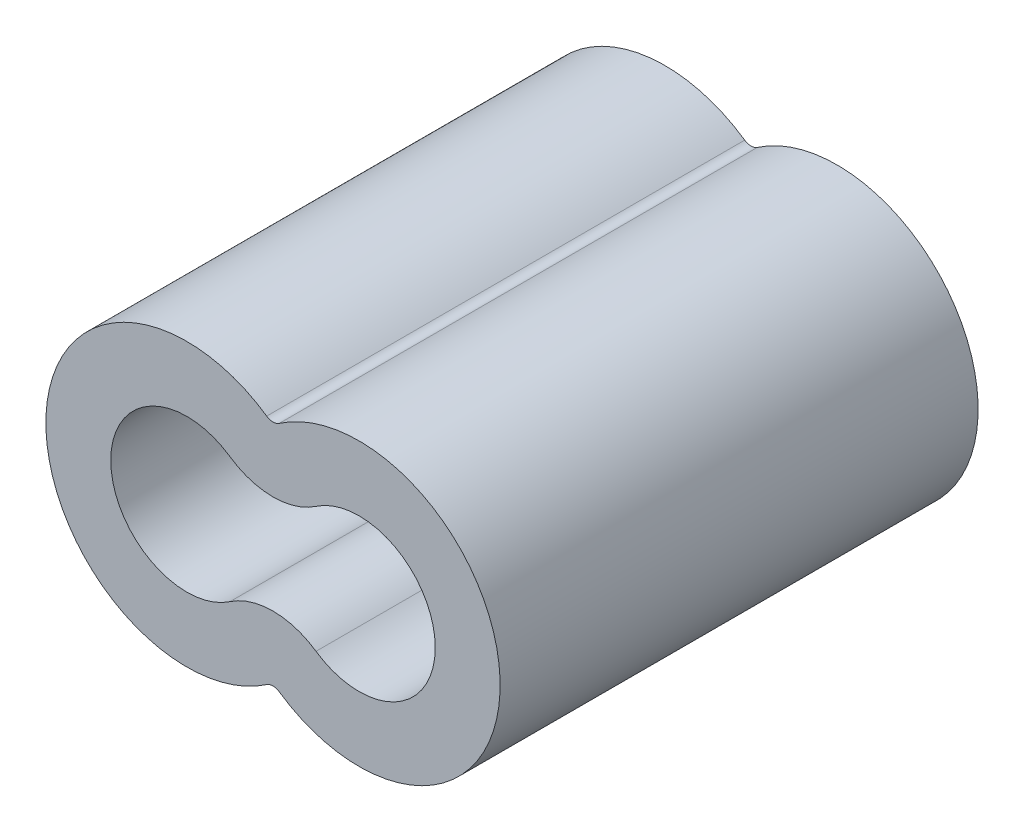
ISO-10303-21;
HEADER;
FILE_DESCRIPTION(('STEP AP214'),'2;1');
FILE_NAME('part.step','',(''),(''),'','','');
FILE_SCHEMA(('AUTOMOTIVE_DESIGN { 1 0 10303 214 1 1 1 1 }'));
ENDSEC;
DATA;
#1=APPLICATION_CONTEXT('core data for automotive mechanical design processes');
#2=APPLICATION_PROTOCOL_DEFINITION('international standard','automotive_design',2000,#1);
#3=PRODUCT_CONTEXT('',#1,'mechanical');
#4=PRODUCT('Part','Part','',(#3));
#5=PRODUCT_RELATED_PRODUCT_CATEGORY('part','',(#4));
#6=PRODUCT_DEFINITION_FORMATION('','',#4);
#7=PRODUCT_DEFINITION_CONTEXT('part definition',#1,'design');
#8=PRODUCT_DEFINITION('design','',#6,#7);
#9=PRODUCT_DEFINITION_SHAPE('','',#8);
#10=(LENGTH_UNIT() NAMED_UNIT(*) SI_UNIT(.MILLI.,.METRE.));
#11=(NAMED_UNIT(*) PLANE_ANGLE_UNIT() SI_UNIT($,.RADIAN.));
#12=(NAMED_UNIT(*) SI_UNIT($,.STERADIAN.) SOLID_ANGLE_UNIT());
#13=UNCERTAINTY_MEASURE_WITH_UNIT(LENGTH_MEASURE(1.E-05),#10,'distance_accuracy_value','');
#14=(GEOMETRIC_REPRESENTATION_CONTEXT(3) GLOBAL_UNCERTAINTY_ASSIGNED_CONTEXT((#13)) GLOBAL_UNIT_ASSIGNED_CONTEXT((#10,
#11,#12)) REPRESENTATION_CONTEXT('',''));
#15=CARTESIAN_POINT('',(0.,0.,0.));
#16=DIRECTION('',(0.,0.,1.));
#17=DIRECTION('',(1.,0.,0.));
#18=AXIS2_PLACEMENT_3D('',#15,#16,#17);
#19=CARTESIAN_POINT('',(0.,-2.55275963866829,0.));
#20=DIRECTION('',(0.,0.,1.));
#21=DIRECTION('',(1.,0.,0.));
#22=AXIS2_PLACEMENT_3D('',#19,#20,#21);
#23=CYLINDRICAL_SURFACE('',#22,1.54708002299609);
#24=CARTESIAN_POINT('',(0.,-2.55275963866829,-4.8641));
#25=DIRECTION('',(0.,0.,1.));
#26=DIRECTION('',(1.,0.,0.));
#27=AXIS2_PLACEMENT_3D('',#24,#25,#26);
#28=CIRCLE('',#27,1.54708002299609);
#29=CARTESIAN_POINT('',(0.875643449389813,-1.27733612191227,-4.8641));
#30=VERTEX_POINT('',#29);
#31=CARTESIAN_POINT('',(-0.875643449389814,-1.27733612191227,-4.8641));
#32=VERTEX_POINT('',#31);
#33=EDGE_CURVE('E158',#30,#32,#28,.T.);
#34=ORIENTED_EDGE('',*,*,#33,.T.);
#35=DIRECTION('',(0.,0.,1.));
#36=VECTOR('',#35,1.);
#37=CARTESIAN_POINT('',(-0.875643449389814,-1.27733612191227,0.));
#38=LINE('',#37,#36);
#39=CARTESIAN_POINT('',(-0.875643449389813,-1.27733612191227,4.8641));
#40=VERTEX_POINT('',#39);
#41=EDGE_CURVE('E141',#32,#40,#38,.T.);
#42=ORIENTED_EDGE('',*,*,#41,.T.);
#43=CARTESIAN_POINT('',(0.,-2.55275963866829,4.8641));
#44=DIRECTION('',(0.,0.,1.));
#45=DIRECTION('',(1.,0.,0.));
#46=AXIS2_PLACEMENT_3D('',#43,#44,#45);
#47=CIRCLE('',#46,1.54708002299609);
#48=CARTESIAN_POINT('',(0.875643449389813,-1.27733612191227,4.8641));
#49=VERTEX_POINT('',#48);
#50=EDGE_CURVE('E176',#49,#40,#47,.T.);
#51=ORIENTED_EDGE('',*,*,#50,.F.);
#52=DIRECTION('',(0.,0.,1.));
#53=VECTOR('',#52,1.);
#54=CARTESIAN_POINT('',(0.875643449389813,-1.27733612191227,0.));
#55=LINE('',#54,#53);
#56=EDGE_CURVE('E132',#49,#30,#55,.F.);
#57=ORIENTED_EDGE('',*,*,#56,.T.);
#58=EDGE_LOOP('',(#34,#42,#51,#57));
#59=FACE_BOUND('',#58,.T.);
#60=ADVANCED_FACE('F19',(#59),#23,.T.);
#61=CARTESIAN_POINT('',(-1.7526,0.,0.));
#62=DIRECTION('',(0.,0.,1.));
#63=DIRECTION('',(1.,0.,0.));
#64=AXIS2_PLACEMENT_3D('',#61,#62,#63);
#65=CYLINDRICAL_SURFACE('',#64,1.5494);
#66=ORIENTED_EDGE('',*,*,#41,.F.);
#67=CARTESIAN_POINT('',(-1.7526,0.,-4.8641));
#68=DIRECTION('',(0.,0.,1.));
#69=DIRECTION('',(1.,0.,0.));
#70=AXIS2_PLACEMENT_3D('',#67,#68,#69);
#71=CIRCLE('',#70,1.5494);
#72=CARTESIAN_POINT('',(-0.875643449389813,1.27733612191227,-4.8641));
#73=VERTEX_POINT('',#72);
#74=EDGE_CURVE('E155',#32,#73,#71,.F.);
#75=ORIENTED_EDGE('',*,*,#74,.T.);
#76=DIRECTION('',(0.,0.,1.));
#77=VECTOR('',#76,1.);
#78=CARTESIAN_POINT('',(-0.875643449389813,1.27733612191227,0.));
#79=LINE('',#78,#77);
#80=CARTESIAN_POINT('',(-0.875643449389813,1.27733612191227,4.8641));
#81=VERTEX_POINT('',#80);
#82=EDGE_CURVE('E135',#81,#73,#79,.F.);
#83=ORIENTED_EDGE('',*,*,#82,.F.);
#84=CARTESIAN_POINT('',(-1.7526,0.,4.8641));
#85=DIRECTION('',(0.,0.,1.));
#86=DIRECTION('',(1.,0.,0.));
#87=AXIS2_PLACEMENT_3D('',#84,#85,#86);
#88=CIRCLE('',#87,1.5494);
#89=EDGE_CURVE('E172',#40,#81,#88,.F.);
#90=ORIENTED_EDGE('',*,*,#89,.F.);
#91=EDGE_LOOP('',(#66,#75,#83,#90));
#92=FACE_BOUND('',#91,.T.);
#93=ADVANCED_FACE('F195',(#92),#65,.F.);
#94=CARTESIAN_POINT('',(0.,2.55275963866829,0.));
#95=DIRECTION('',(0.,0.,1.));
#96=DIRECTION('',(1.,0.,0.));
#97=AXIS2_PLACEMENT_3D('',#94,#95,#96);
#98=CYLINDRICAL_SURFACE('',#97,1.54708002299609);
#99=CARTESIAN_POINT('',(0.,2.55275963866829,-4.8641));
#100=DIRECTION('',(0.,0.,1.));
#101=DIRECTION('',(1.,0.,0.));
#102=AXIS2_PLACEMENT_3D('',#99,#100,#101);
#103=CIRCLE('',#102,1.54708002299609);
#104=CARTESIAN_POINT('',(0.875643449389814,1.27733612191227,-4.8641));
#105=VERTEX_POINT('',#104);
#106=EDGE_CURVE('E128',#73,#105,#103,.T.);
#107=ORIENTED_EDGE('',*,*,#106,.T.);
#108=DIRECTION('',(0.,0.,1.));
#109=VECTOR('',#108,1.);
#110=CARTESIAN_POINT('',(0.875643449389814,1.27733612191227,0.));
#111=LINE('',#110,#109);
#112=CARTESIAN_POINT('',(0.875643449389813,1.27733612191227,4.8641));
#113=VERTEX_POINT('',#112);
#114=EDGE_CURVE('E107',#105,#113,#111,.T.);
#115=ORIENTED_EDGE('',*,*,#114,.T.);
#116=CARTESIAN_POINT('',(0.,2.55275963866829,4.8641));
#117=DIRECTION('',(0.,0.,1.));
#118=DIRECTION('',(1.,0.,0.));
#119=AXIS2_PLACEMENT_3D('',#116,#117,#118);
#120=CIRCLE('',#119,1.54708002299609);
#121=EDGE_CURVE('E146',#81,#113,#120,.T.);
#122=ORIENTED_EDGE('',*,*,#121,.F.);
#123=ORIENTED_EDGE('',*,*,#82,.T.);
#124=EDGE_LOOP('',(#107,#115,#122,#123));
#125=FACE_BOUND('',#124,.T.);
#126=ADVANCED_FACE('F198',(#125),#98,.T.);
#127=CARTESIAN_POINT('',(1.7526,0.,0.));
#128=DIRECTION('',(0.,0.,1.));
#129=DIRECTION('',(1.,0.,0.));
#130=AXIS2_PLACEMENT_3D('',#127,#128,#129);
#131=CYLINDRICAL_SURFACE('',#130,1.5494);
#132=ORIENTED_EDGE('',*,*,#114,.F.);
#133=CARTESIAN_POINT('',(1.7526,0.,-4.8641));
#134=DIRECTION('',(0.,0.,1.));
#135=DIRECTION('',(1.,0.,0.));
#136=AXIS2_PLACEMENT_3D('',#133,#134,#135);
#137=CIRCLE('',#136,1.5494);
#138=EDGE_CURVE('E119',#105,#30,#137,.F.);
#139=ORIENTED_EDGE('',*,*,#138,.T.);
#140=ORIENTED_EDGE('',*,*,#56,.F.);
#141=CARTESIAN_POINT('',(1.7526,0.,4.8641));
#142=DIRECTION('',(0.,0.,1.));
#143=DIRECTION('',(1.,0.,0.));
#144=AXIS2_PLACEMENT_3D('',#141,#142,#143);
#145=CIRCLE('',#144,1.5494);
#146=EDGE_CURVE('E106',#113,#49,#145,.F.);
#147=ORIENTED_EDGE('',*,*,#146,.F.);
#148=EDGE_LOOP('',(#132,#139,#140,#147));
#149=FACE_BOUND('',#148,.T.);
#150=ADVANCED_FACE('F187',(#149),#131,.F.);
#151=CARTESIAN_POINT('',(1.7526,0.,0.));
#152=DIRECTION('',(0.,0.,1.));
#153=DIRECTION('',(1.,0.,0.));
#154=AXIS2_PLACEMENT_3D('',#151,#152,#153);
#155=CYLINDRICAL_SURFACE('',#154,2.8702);
#156=CARTESIAN_POINT('',(1.7526,0.,-4.8641));
#157=DIRECTION('',(0.,0.,1.));
#158=DIRECTION('',(1.,0.,0.));
#159=AXIS2_PLACEMENT_3D('',#156,#157,#158);
#160=CIRCLE('',#159,2.8702);
#161=CARTESIAN_POINT('',(0.128073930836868,-2.36621281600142,-4.8641));
#162=VERTEX_POINT('',#161);
#163=CARTESIAN_POINT('',(0.128073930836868,2.36621281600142,-4.8641));
#164=VERTEX_POINT('',#163);
#165=EDGE_CURVE('E161',#162,#164,#160,.T.);
#166=ORIENTED_EDGE('',*,*,#165,.T.);
#167=DIRECTION('',(0.,0.,1.));
#168=VECTOR('',#167,1.);
#169=CARTESIAN_POINT('',(0.128073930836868,2.36621281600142,0.));
#170=LINE('',#169,#168);
#171=CARTESIAN_POINT('',(0.128073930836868,2.36621281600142,4.8641));
#172=VERTEX_POINT('',#171);
#173=EDGE_CURVE('E102',#164,#172,#170,.T.);
#174=ORIENTED_EDGE('',*,*,#173,.T.);
#175=CARTESIAN_POINT('',(1.7526,0.,4.8641));
#176=DIRECTION('',(0.,0.,1.));
#177=DIRECTION('',(1.,0.,0.));
#178=AXIS2_PLACEMENT_3D('',#175,#176,#177);
#179=CIRCLE('',#178,2.8702);
#180=CARTESIAN_POINT('',(0.128073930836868,-2.36621281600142,4.8641));
#181=VERTEX_POINT('',#180);
#182=EDGE_CURVE('E22',#181,#172,#179,.T.);
#183=ORIENTED_EDGE('',*,*,#182,.F.);
#184=DIRECTION('',(0.,0.,1.));
#185=VECTOR('',#184,1.);
#186=CARTESIAN_POINT('',(0.128073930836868,-2.36621281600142,0.));
#187=LINE('',#186,#185);
#188=EDGE_CURVE('E101',#181,#162,#187,.F.);
#189=ORIENTED_EDGE('',*,*,#188,.T.);
#190=EDGE_LOOP('',(#166,#174,#183,#189));
#191=FACE_BOUND('',#190,.T.);
#192=ADVANCED_FACE('F99',(#191),#155,.T.);
#193=CARTESIAN_POINT('',(0.,0.,4.8641));
#194=DIRECTION('',(0.,0.,1.));
#195=DIRECTION('',(1.,0.,0.));
#196=AXIS2_PLACEMENT_3D('',#193,#194,#195);
#197=PLANE('',#196);
#198=ORIENTED_EDGE('',*,*,#89,.T.);
#199=ORIENTED_EDGE('',*,*,#121,.T.);
#200=ORIENTED_EDGE('',*,*,#146,.T.);
#201=ORIENTED_EDGE('',*,*,#50,.T.);
#202=EDGE_LOOP('',(#198,#199,#200,#201));
#203=FACE_BOUND('',#202,.T.);
#204=ORIENTED_EDGE('',*,*,#182,.T.);
#205=CARTESIAN_POINT('',(0.,2.55275963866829,4.8641));
#206=DIRECTION('',(0.,0.,1.));
#207=DIRECTION('',(1.,0.,0.));
#208=AXIS2_PLACEMENT_3D('',#205,#206,#207);
#209=CIRCLE('',#208,0.226280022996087);
#210=CARTESIAN_POINT('',(-0.128073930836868,2.36621281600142,4.8641));
#211=VERTEX_POINT('',#210);
#212=EDGE_CURVE('E145',#172,#211,#209,.F.);
#213=ORIENTED_EDGE('',*,*,#212,.T.);
#214=CARTESIAN_POINT('',(-1.7526,0.,4.8641));
#215=DIRECTION('',(0.,0.,1.));
#216=DIRECTION('',(1.,0.,0.));
#217=AXIS2_PLACEMENT_3D('',#214,#215,#216);
#218=CIRCLE('',#217,2.8702);
#219=CARTESIAN_POINT('',(-0.128073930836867,-2.36621281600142,4.8641));
#220=VERTEX_POINT('',#219);
#221=EDGE_CURVE('E113',#220,#211,#218,.F.);
#222=ORIENTED_EDGE('',*,*,#221,.F.);
#223=CARTESIAN_POINT('',(0.,-2.55275963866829,4.8641));
#224=DIRECTION('',(0.,0.,1.));
#225=DIRECTION('',(1.,0.,0.));
#226=AXIS2_PLACEMENT_3D('',#223,#224,#225);
#227=CIRCLE('',#226,0.226280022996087);
#228=EDGE_CURVE('E110',#220,#181,#227,.F.);
#229=ORIENTED_EDGE('',*,*,#228,.T.);
#230=EDGE_LOOP('',(#204,#213,#222,#229));
#231=FACE_BOUND('',#230,.T.);
#232=ADVANCED_FACE('F111',(#203,#231),#197,.T.);
#233=CARTESIAN_POINT('',(0.,2.55275963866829,0.));
#234=DIRECTION('',(0.,0.,1.));
#235=DIRECTION('',(1.,0.,0.));
#236=AXIS2_PLACEMENT_3D('',#233,#234,#235);
#237=CYLINDRICAL_SURFACE('',#236,0.226280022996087);
#238=ORIENTED_EDGE('',*,*,#173,.F.);
#239=CARTESIAN_POINT('',(0.,2.55275963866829,-4.8641));
#240=DIRECTION('',(0.,0.,1.));
#241=DIRECTION('',(1.,0.,0.));
#242=AXIS2_PLACEMENT_3D('',#239,#240,#241);
#243=CIRCLE('',#242,0.226280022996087);
#244=CARTESIAN_POINT('',(-0.128073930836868,2.36621281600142,-4.8641));
#245=VERTEX_POINT('',#244);
#246=EDGE_CURVE('E164',#164,#245,#243,.F.);
#247=ORIENTED_EDGE('',*,*,#246,.T.);
#248=DIRECTION('',(0.,0.,1.));
#249=VECTOR('',#248,1.);
#250=CARTESIAN_POINT('',(-0.128073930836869,2.36621281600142,0.));
#251=LINE('',#250,#249);
#252=EDGE_CURVE('E150',#211,#245,#251,.F.);
#253=ORIENTED_EDGE('',*,*,#252,.F.);
#254=ORIENTED_EDGE('',*,*,#212,.F.);
#255=EDGE_LOOP('',(#238,#247,#253,#254));
#256=FACE_BOUND('',#255,.T.);
#257=ADVANCED_FACE('F202',(#256),#237,.F.);
#258=CARTESIAN_POINT('',(0.,0.,-4.8641));
#259=DIRECTION('',(0.,0.,1.));
#260=DIRECTION('',(1.,0.,0.));
#261=AXIS2_PLACEMENT_3D('',#258,#259,#260);
#262=PLANE('',#261);
#263=ORIENTED_EDGE('',*,*,#106,.F.);
#264=ORIENTED_EDGE('',*,*,#74,.F.);
#265=ORIENTED_EDGE('',*,*,#33,.F.);
#266=ORIENTED_EDGE('',*,*,#138,.F.);
#267=EDGE_LOOP('',(#263,#264,#265,#266));
#268=FACE_BOUND('',#267,.T.);
#269=CARTESIAN_POINT('',(0.,-2.55275963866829,-4.8641));
#270=DIRECTION('',(0.,0.,1.));
#271=DIRECTION('',(1.,0.,0.));
#272=AXIS2_PLACEMENT_3D('',#269,#270,#271);
#273=CIRCLE('',#272,0.226280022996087);
#274=CARTESIAN_POINT('',(-0.128073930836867,-2.36621281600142,-4.8641));
#275=VERTEX_POINT('',#274);
#276=EDGE_CURVE('E42',#162,#275,#273,.T.);
#277=ORIENTED_EDGE('',*,*,#276,.T.);
#278=CARTESIAN_POINT('',(-1.7526,0.,-4.8641));
#279=DIRECTION('',(0.,0.,1.));
#280=DIRECTION('',(1.,0.,0.));
#281=AXIS2_PLACEMENT_3D('',#278,#279,#280);
#282=CIRCLE('',#281,2.8702);
#283=EDGE_CURVE('E29',#245,#275,#282,.T.);
#284=ORIENTED_EDGE('',*,*,#283,.F.);
#285=ORIENTED_EDGE('',*,*,#246,.F.);
#286=ORIENTED_EDGE('',*,*,#165,.F.);
#287=EDGE_LOOP('',(#277,#284,#285,#286));
#288=FACE_BOUND('',#287,.T.);
#289=ADVANCED_FACE('F200',(#268,#288),#262,.F.);
#290=CARTESIAN_POINT('',(0.,-2.55275963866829,0.));
#291=DIRECTION('',(0.,0.,1.));
#292=DIRECTION('',(1.,0.,0.));
#293=AXIS2_PLACEMENT_3D('',#290,#291,#292);
#294=CYLINDRICAL_SURFACE('',#293,0.226280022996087);
#295=DIRECTION('',(0.,0.,1.));
#296=VECTOR('',#295,1.);
#297=CARTESIAN_POINT('',(-0.128073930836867,-2.36621281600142,0.));
#298=LINE('',#297,#296);
#299=EDGE_CURVE('E11',#275,#220,#298,.T.);
#300=ORIENTED_EDGE('',*,*,#299,.F.);
#301=ORIENTED_EDGE('',*,*,#276,.F.);
#302=ORIENTED_EDGE('',*,*,#188,.F.);
#303=ORIENTED_EDGE('',*,*,#228,.F.);
#304=EDGE_LOOP('',(#300,#301,#302,#303));
#305=FACE_BOUND('',#304,.T.);
#306=ADVANCED_FACE('F117',(#305),#294,.F.);
#307=CARTESIAN_POINT('',(-1.7526,0.,0.));
#308=DIRECTION('',(0.,0.,1.));
#309=DIRECTION('',(1.,0.,0.));
#310=AXIS2_PLACEMENT_3D('',#307,#308,#309);
#311=CYLINDRICAL_SURFACE('',#310,2.8702);
#312=ORIENTED_EDGE('',*,*,#283,.T.);
#313=ORIENTED_EDGE('',*,*,#299,.T.);
#314=ORIENTED_EDGE('',*,*,#221,.T.);
#315=ORIENTED_EDGE('',*,*,#252,.T.);
#316=EDGE_LOOP('',(#312,#313,#314,#315));
#317=FACE_BOUND('',#316,.T.);
#318=ADVANCED_FACE('F209',(#317),#311,.T.);
#319=CLOSED_SHELL('',(#60,#93,#126,#150,#192,#232,#257,#289,#306,#318));
#320=MANIFOLD_SOLID_BREP('B1',#319);
#321=ADVANCED_BREP_SHAPE_REPRESENTATION('',(#18,#320),#14);
#322=SHAPE_DEFINITION_REPRESENTATION(#9,#321);
ENDSEC;
END-ISO-10303-21;
